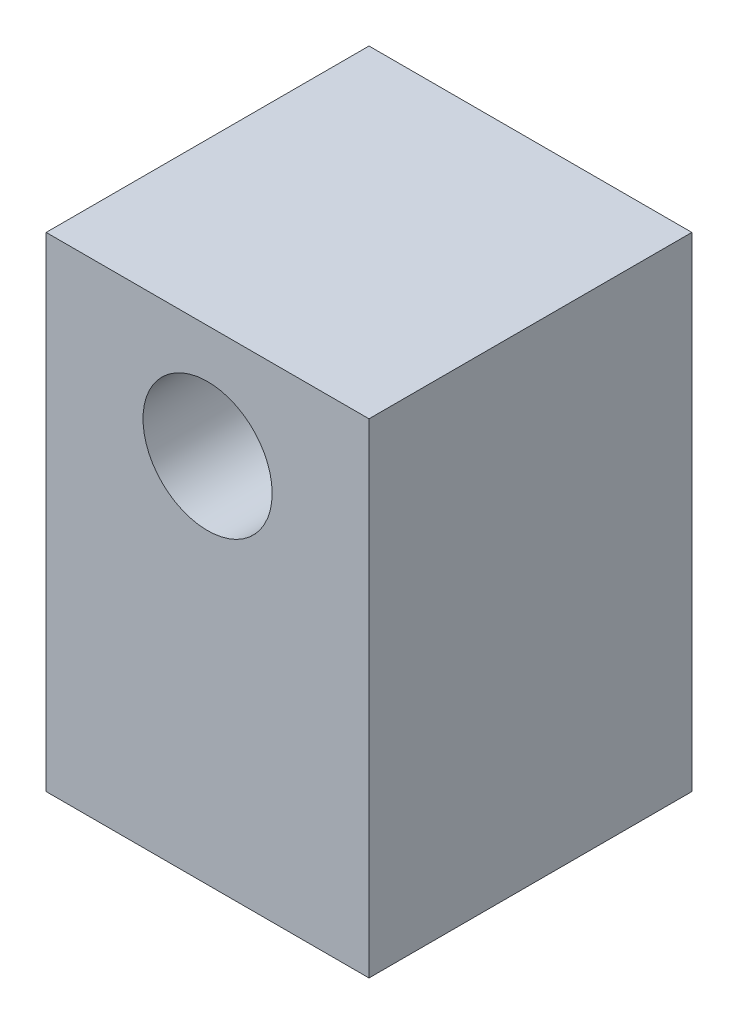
ISO-10303-21;
HEADER;
FILE_DESCRIPTION(('STEP AP214'),'2;1');
FILE_NAME('part.step','',(''),(''),'','','');
FILE_SCHEMA(('AUTOMOTIVE_DESIGN { 1 0 10303 214 1 1 1 1 }'));
ENDSEC;
DATA;
#1=APPLICATION_CONTEXT('core data for automotive mechanical design processes');
#2=APPLICATION_PROTOCOL_DEFINITION('international standard','automotive_design',2000,#1);
#3=PRODUCT_CONTEXT('',#1,'mechanical');
#4=PRODUCT('Part','Part','',(#3));
#5=PRODUCT_RELATED_PRODUCT_CATEGORY('part','',(#4));
#6=PRODUCT_DEFINITION_FORMATION('','',#4);
#7=PRODUCT_DEFINITION_CONTEXT('part definition',#1,'design');
#8=PRODUCT_DEFINITION('design','',#6,#7);
#9=PRODUCT_DEFINITION_SHAPE('','',#8);
#10=(LENGTH_UNIT() NAMED_UNIT(*) SI_UNIT(.MILLI.,.METRE.));
#11=(NAMED_UNIT(*) PLANE_ANGLE_UNIT() SI_UNIT($,.RADIAN.));
#12=(NAMED_UNIT(*) SI_UNIT($,.STERADIAN.) SOLID_ANGLE_UNIT());
#13=UNCERTAINTY_MEASURE_WITH_UNIT(LENGTH_MEASURE(1.E-05),#10,'distance_accuracy_value','');
#14=(GEOMETRIC_REPRESENTATION_CONTEXT(3) GLOBAL_UNCERTAINTY_ASSIGNED_CONTEXT((#13)) GLOBAL_UNIT_ASSIGNED_CONTEXT((#10,
#11,#12)) REPRESENTATION_CONTEXT('',''));
#15=CARTESIAN_POINT('',(0.,0.,0.));
#16=DIRECTION('',(0.,0.,1.));
#17=DIRECTION('',(1.,0.,0.));
#18=AXIS2_PLACEMENT_3D('',#15,#16,#17);
#19=CARTESIAN_POINT('',(0.,0.,50.));
#20=DIRECTION('',(0.,0.,1.));
#21=DIRECTION('',(1.,0.,0.));
#22=AXIS2_PLACEMENT_3D('',#19,#20,#21);
#23=PLANE('',#22);
#24=DIRECTION('',(0.,-1.,0.));
#25=VECTOR('',#24,1.);
#26=CARTESIAN_POINT('',(-50.,-75.,50.));
#27=LINE('',#26,#25);
#28=CARTESIAN_POINT('',(-50.,75.,50.));
#29=VERTEX_POINT('',#28);
#30=CARTESIAN_POINT('',(-50.,-75.,50.));
#31=VERTEX_POINT('',#30);
#32=EDGE_CURVE('E98',#29,#31,#27,.T.);
#33=ORIENTED_EDGE('',*,*,#32,.T.);
#34=DIRECTION('',(1.,0.,0.));
#35=VECTOR('',#34,1.);
#36=CARTESIAN_POINT('',(50.,-75.,50.));
#37=LINE('',#36,#35);
#38=CARTESIAN_POINT('',(50.,-75.,50.));
#39=VERTEX_POINT('',#38);
#40=EDGE_CURVE('E93',#31,#39,#37,.T.);
#41=ORIENTED_EDGE('',*,*,#40,.T.);
#42=DIRECTION('',(0.,1.,0.));
#43=VECTOR('',#42,1.);
#44=CARTESIAN_POINT('',(50.,-75.,50.));
#45=LINE('',#44,#43);
#46=CARTESIAN_POINT('',(50.,75.,50.));
#47=VERTEX_POINT('',#46);
#48=EDGE_CURVE('E96',#39,#47,#45,.T.);
#49=ORIENTED_EDGE('',*,*,#48,.T.);
#50=DIRECTION('',(-1.,0.,0.));
#51=VECTOR('',#50,1.);
#52=CARTESIAN_POINT('',(50.,75.,50.));
#53=LINE('',#52,#51);
#54=EDGE_CURVE('E63',#47,#29,#53,.T.);
#55=ORIENTED_EDGE('',*,*,#54,.T.);
#56=EDGE_LOOP('',(#33,#41,#49,#55));
#57=FACE_BOUND('',#56,.T.);
#58=CARTESIAN_POINT('',(0.,40.,50.));
#59=DIRECTION('',(0.,0.,1.));
#60=DIRECTION('',(1.,0.,0.));
#61=AXIS2_PLACEMENT_3D('',#58,#59,#60);
#62=CIRCLE('',#61,20.);
#63=CARTESIAN_POINT('',(20.,40.,50.));
#64=VERTEX_POINT('',#63);
#65=EDGE_CURVE('E118',#64,#64,#62,.T.);
#66=ORIENTED_EDGE('',*,*,#65,.F.);
#67=EDGE_LOOP('',(#66));
#68=FACE_BOUND('',#67,.T.);
#69=ADVANCED_FACE('F45',(#57,#68),#23,.T.);
#70=CARTESIAN_POINT('',(0.,0.,-50.));
#71=DIRECTION('',(0.,0.,1.));
#72=DIRECTION('',(1.,0.,0.));
#73=AXIS2_PLACEMENT_3D('',#70,#71,#72);
#74=PLANE('',#73);
#75=DIRECTION('',(0.,-1.,0.));
#76=VECTOR('',#75,1.);
#77=CARTESIAN_POINT('',(-50.,-75.,-50.));
#78=LINE('',#77,#76);
#79=CARTESIAN_POINT('',(-50.,75.,-50.));
#80=VERTEX_POINT('',#79);
#81=CARTESIAN_POINT('',(-50.,-75.,-50.));
#82=VERTEX_POINT('',#81);
#83=EDGE_CURVE('E114',#80,#82,#78,.T.);
#84=ORIENTED_EDGE('',*,*,#83,.F.);
#85=DIRECTION('',(-1.,0.,0.));
#86=VECTOR('',#85,1.);
#87=CARTESIAN_POINT('',(50.,75.,-50.));
#88=LINE('',#87,#86);
#89=CARTESIAN_POINT('',(50.,75.,-50.));
#90=VERTEX_POINT('',#89);
#91=EDGE_CURVE('E86',#90,#80,#88,.T.);
#92=ORIENTED_EDGE('',*,*,#91,.F.);
#93=DIRECTION('',(0.,1.,0.));
#94=VECTOR('',#93,1.);
#95=CARTESIAN_POINT('',(50.,-75.,-50.));
#96=LINE('',#95,#94);
#97=CARTESIAN_POINT('',(50.,-75.,-50.));
#98=VERTEX_POINT('',#97);
#99=EDGE_CURVE('E80',#98,#90,#96,.T.);
#100=ORIENTED_EDGE('',*,*,#99,.F.);
#101=DIRECTION('',(1.,0.,0.));
#102=VECTOR('',#101,1.);
#103=CARTESIAN_POINT('',(50.,-75.,-50.));
#104=LINE('',#103,#102);
#105=EDGE_CURVE('E103',#82,#98,#104,.T.);
#106=ORIENTED_EDGE('',*,*,#105,.F.);
#107=EDGE_LOOP('',(#84,#92,#100,#106));
#108=FACE_BOUND('',#107,.T.);
#109=CARTESIAN_POINT('',(0.,40.,-50.));
#110=DIRECTION('',(0.,0.,1.));
#111=DIRECTION('',(1.,0.,0.));
#112=AXIS2_PLACEMENT_3D('',#109,#110,#111);
#113=CIRCLE('',#112,20.);
#114=CARTESIAN_POINT('',(20.,40.,-50.));
#115=VERTEX_POINT('',#114);
#116=EDGE_CURVE('E136',#115,#115,#113,.T.);
#117=ORIENTED_EDGE('',*,*,#116,.T.);
#118=EDGE_LOOP('',(#117));
#119=FACE_BOUND('',#118,.T.);
#120=ADVANCED_FACE('F131',(#108,#119),#74,.F.);
#121=CARTESIAN_POINT('',(-50.,-75.,50.));
#122=DIRECTION('',(1.,0.,0.));
#123=DIRECTION('',(0.,0.,-1.));
#124=AXIS2_PLACEMENT_3D('',#121,#122,#123);
#125=PLANE('',#124);
#126=ORIENTED_EDGE('',*,*,#83,.T.);
#127=DIRECTION('',(0.,0.,-1.));
#128=VECTOR('',#127,1.);
#129=CARTESIAN_POINT('',(-50.,-75.,50.));
#130=LINE('',#129,#128);
#131=EDGE_CURVE('E11',#31,#82,#130,.T.);
#132=ORIENTED_EDGE('',*,*,#131,.F.);
#133=ORIENTED_EDGE('',*,*,#32,.F.);
#134=DIRECTION('',(0.,0.,-1.));
#135=VECTOR('',#134,1.);
#136=CARTESIAN_POINT('',(-50.,75.,50.));
#137=LINE('',#136,#135);
#138=EDGE_CURVE('E110',#29,#80,#137,.T.);
#139=ORIENTED_EDGE('',*,*,#138,.T.);
#140=EDGE_LOOP('',(#126,#132,#133,#139));
#141=FACE_BOUND('',#140,.T.);
#142=ADVANCED_FACE('F47',(#141),#125,.F.);
#143=CARTESIAN_POINT('',(50.,-75.,50.));
#144=DIRECTION('',(0.,1.,0.));
#145=DIRECTION('',(0.,0.,1.));
#146=AXIS2_PLACEMENT_3D('',#143,#144,#145);
#147=PLANE('',#146);
#148=ORIENTED_EDGE('',*,*,#105,.T.);
#149=DIRECTION('',(0.,0.,-1.));
#150=VECTOR('',#149,1.);
#151=CARTESIAN_POINT('',(50.,-75.,50.));
#152=LINE('',#151,#150);
#153=EDGE_CURVE('E55',#39,#98,#152,.T.);
#154=ORIENTED_EDGE('',*,*,#153,.F.);
#155=ORIENTED_EDGE('',*,*,#40,.F.);
#156=ORIENTED_EDGE('',*,*,#131,.T.);
#157=EDGE_LOOP('',(#148,#154,#155,#156));
#158=FACE_BOUND('',#157,.T.);
#159=ADVANCED_FACE('F102',(#158),#147,.F.);
#160=CARTESIAN_POINT('',(50.,-75.,50.));
#161=DIRECTION('',(-1.,0.,0.));
#162=DIRECTION('',(0.,0.,1.));
#163=AXIS2_PLACEMENT_3D('',#160,#161,#162);
#164=PLANE('',#163);
#165=ORIENTED_EDGE('',*,*,#99,.T.);
#166=DIRECTION('',(0.,0.,-1.));
#167=VECTOR('',#166,1.);
#168=CARTESIAN_POINT('',(50.,75.,50.));
#169=LINE('',#168,#167);
#170=EDGE_CURVE('E105',#47,#90,#169,.T.);
#171=ORIENTED_EDGE('',*,*,#170,.F.);
#172=ORIENTED_EDGE('',*,*,#48,.F.);
#173=ORIENTED_EDGE('',*,*,#153,.T.);
#174=EDGE_LOOP('',(#165,#171,#172,#173));
#175=FACE_BOUND('',#174,.T.);
#176=ADVANCED_FACE('F106',(#175),#164,.F.);
#177=CARTESIAN_POINT('',(50.,75.,50.));
#178=DIRECTION('',(0.,-1.,0.));
#179=DIRECTION('',(0.,0.,-1.));
#180=AXIS2_PLACEMENT_3D('',#177,#178,#179);
#181=PLANE('',#180);
#182=ORIENTED_EDGE('',*,*,#91,.T.);
#183=ORIENTED_EDGE('',*,*,#138,.F.);
#184=ORIENTED_EDGE('',*,*,#54,.F.);
#185=ORIENTED_EDGE('',*,*,#170,.T.);
#186=EDGE_LOOP('',(#182,#183,#184,#185));
#187=FACE_BOUND('',#186,.T.);
#188=ADVANCED_FACE('F128',(#187),#181,.F.);
#189=CARTESIAN_POINT('',(0.,40.,50.));
#190=DIRECTION('',(0.,0.,-1.));
#191=DIRECTION('',(-1.,0.,0.));
#192=AXIS2_PLACEMENT_3D('',#189,#190,#191);
#193=CYLINDRICAL_SURFACE('',#192,20.);
#194=ORIENTED_EDGE('',*,*,#65,.T.);
#195=EDGE_LOOP('',(#194));
#196=FACE_BOUND('',#195,.T.);
#197=ORIENTED_EDGE('',*,*,#116,.F.);
#198=EDGE_LOOP('',(#197));
#199=FACE_BOUND('',#198,.T.);
#200=ADVANCED_FACE('F144',(#196,#199),#193,.F.);
#201=CLOSED_SHELL('',(#69,#120,#142,#159,#176,#188,#200));
#202=MANIFOLD_SOLID_BREP('B2',#201);
#203=ADVANCED_BREP_SHAPE_REPRESENTATION('',(#18,#202),#14);
#204=SHAPE_DEFINITION_REPRESENTATION(#9,#203);
ENDSEC;
END-ISO-10303-21;
